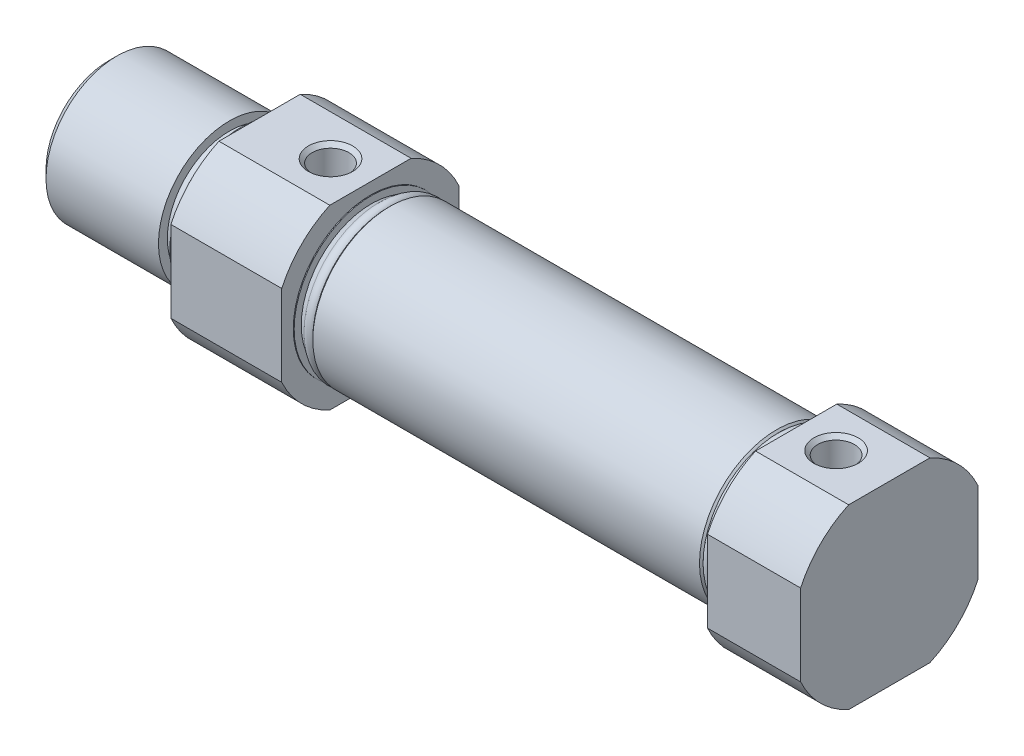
ISO-10303-21;
HEADER;
FILE_DESCRIPTION(('STEP AP214'),'2;1');
FILE_NAME('part.step','',(''),(''),'','','');
FILE_SCHEMA(('AUTOMOTIVE_DESIGN { 1 0 10303 214 1 1 1 1 }'));
ENDSEC;
DATA;
#1=APPLICATION_CONTEXT('core data for automotive mechanical design processes');
#2=APPLICATION_PROTOCOL_DEFINITION('international standard','automotive_design',2000,#1);
#3=PRODUCT_CONTEXT('',#1,'mechanical');
#4=PRODUCT('Part','Part','',(#3));
#5=PRODUCT_RELATED_PRODUCT_CATEGORY('part','',(#4));
#6=PRODUCT_DEFINITION_FORMATION('','',#4);
#7=PRODUCT_DEFINITION_CONTEXT('part definition',#1,'design');
#8=PRODUCT_DEFINITION('design','',#6,#7);
#9=PRODUCT_DEFINITION_SHAPE('','',#8);
#10=(LENGTH_UNIT() NAMED_UNIT(*) SI_UNIT(.MILLI.,.METRE.));
#11=(NAMED_UNIT(*) PLANE_ANGLE_UNIT() SI_UNIT($,.RADIAN.));
#12=(NAMED_UNIT(*) SI_UNIT($,.STERADIAN.) SOLID_ANGLE_UNIT());
#13=UNCERTAINTY_MEASURE_WITH_UNIT(LENGTH_MEASURE(1.E-05),#10,'distance_accuracy_value','');
#14=(GEOMETRIC_REPRESENTATION_CONTEXT(3) GLOBAL_UNCERTAINTY_ASSIGNED_CONTEXT((#13)) GLOBAL_UNIT_ASSIGNED_CONTEXT((#10,
#11,#12)) REPRESENTATION_CONTEXT('',''));
#15=CARTESIAN_POINT('',(0.,0.,0.));
#16=DIRECTION('',(0.,0.,1.));
#17=DIRECTION('',(1.,0.,0.));
#18=AXIS2_PLACEMENT_3D('',#15,#16,#17);
#19=CARTESIAN_POINT('',(60.5,8.7,0.));
#20=DIRECTION('',(1.,0.,0.));
#21=DIRECTION('',(0.,0.,-1.));
#22=AXIS2_PLACEMENT_3D('',#19,#20,#21);
#23=PLANE('',#22);
#24=CARTESIAN_POINT('',(60.5,0.,0.));
#25=DIRECTION('',(-1.,0.,0.));
#26=DIRECTION('',(0.,0.,1.));
#27=AXIS2_PLACEMENT_3D('',#24,#25,#26);
#28=CIRCLE('',#27,8.7);
#29=CARTESIAN_POINT('',(60.5,0.,8.7));
#30=VERTEX_POINT('',#29);
#31=EDGE_CURVE('E412',#30,#30,#28,.T.);
#32=ORIENTED_EDGE('',*,*,#31,.F.);
#33=EDGE_LOOP('',(#32));
#34=FACE_BOUND('',#33,.T.);
#35=DIRECTION('',(0.,0.,1.));
#36=VECTOR('',#35,1.);
#37=CARTESIAN_POINT('',(60.5,10.,-10.));
#38=LINE('',#37,#36);
#39=CARTESIAN_POINT('',(60.5,10.,-4.58257569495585));
#40=VERTEX_POINT('',#39);
#41=CARTESIAN_POINT('',(60.5,10.,4.58257569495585));
#42=VERTEX_POINT('',#41);
#43=EDGE_CURVE('E217',#40,#42,#38,.T.);
#44=ORIENTED_EDGE('',*,*,#43,.F.);
#45=CARTESIAN_POINT('',(60.5,0.,0.));
#46=DIRECTION('',(-1.,0.,0.));
#47=DIRECTION('',(0.,0.,1.));
#48=AXIS2_PLACEMENT_3D('',#45,#46,#47);
#49=CIRCLE('',#48,11.);
#50=CARTESIAN_POINT('',(60.5,4.58257569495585,-10.));
#51=VERTEX_POINT('',#50);
#52=EDGE_CURVE('E410',#40,#51,#49,.T.);
#53=ORIENTED_EDGE('',*,*,#52,.T.);
#54=DIRECTION('',(0.,1.,0.));
#55=VECTOR('',#54,1.);
#56=CARTESIAN_POINT('',(60.5,-10.,-10.));
#57=LINE('',#56,#55);
#58=CARTESIAN_POINT('',(60.5,-4.58257569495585,-10.));
#59=VERTEX_POINT('',#58);
#60=EDGE_CURVE('E211',#59,#51,#57,.T.);
#61=ORIENTED_EDGE('',*,*,#60,.F.);
#62=CARTESIAN_POINT('',(60.5,-10.,-4.58257569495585));
#63=VERTEX_POINT('',#62);
#64=EDGE_CURVE('E155',#59,#63,#49,.T.);
#65=ORIENTED_EDGE('',*,*,#64,.T.);
#66=DIRECTION('',(0.,0.,-1.));
#67=VECTOR('',#66,1.);
#68=CARTESIAN_POINT('',(60.5,-10.,10.));
#69=LINE('',#68,#67);
#70=CARTESIAN_POINT('',(60.5,-10.,4.58257569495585));
#71=VERTEX_POINT('',#70);
#72=EDGE_CURVE('E213',#71,#63,#69,.T.);
#73=ORIENTED_EDGE('',*,*,#72,.F.);
#74=CARTESIAN_POINT('',(60.5,-4.58257569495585,10.));
#75=VERTEX_POINT('',#74);
#76=EDGE_CURVE('E150',#71,#75,#49,.T.);
#77=ORIENTED_EDGE('',*,*,#76,.T.);
#78=DIRECTION('',(0.,-1.,0.));
#79=VECTOR('',#78,1.);
#80=CARTESIAN_POINT('',(60.5,10.,10.));
#81=LINE('',#80,#79);
#82=CARTESIAN_POINT('',(60.5,4.58257569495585,10.));
#83=VERTEX_POINT('',#82);
#84=EDGE_CURVE('E215',#83,#75,#81,.T.);
#85=ORIENTED_EDGE('',*,*,#84,.F.);
#86=EDGE_CURVE('E145',#83,#42,#49,.T.);
#87=ORIENTED_EDGE('',*,*,#86,.T.);
#88=EDGE_LOOP('',(#44,#53,#61,#65,#73,#77,#85,#87));
#89=FACE_BOUND('',#88,.T.);
#90=ADVANCED_FACE('F16',(#34,#89),#23,.F.);
#91=CARTESIAN_POINT('',(71.,0.,0.));
#92=DIRECTION('',(-1.,0.,0.));
#93=DIRECTION('',(0.,0.,1.));
#94=AXIS2_PLACEMENT_3D('',#91,#92,#93);
#95=CYLINDRICAL_SURFACE('',#94,11.);
#96=DIRECTION('',(-1.,0.,0.));
#97=VECTOR('',#96,1.);
#98=CARTESIAN_POINT('',(71.,10.,-4.58257569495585));
#99=LINE('',#98,#97);
#100=CARTESIAN_POINT('',(71.,10.,-4.58257569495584));
#101=VERTEX_POINT('',#100);
#102=EDGE_CURVE('E199',#101,#40,#99,.T.);
#103=ORIENTED_EDGE('',*,*,#102,.F.);
#104=CARTESIAN_POINT('',(71.,0.,0.));
#105=DIRECTION('',(-1.,0.,0.));
#106=DIRECTION('',(0.,0.,1.));
#107=AXIS2_PLACEMENT_3D('',#104,#105,#106);
#108=CIRCLE('',#107,11.);
#109=CARTESIAN_POINT('',(71.,4.58257569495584,-10.));
#110=VERTEX_POINT('',#109);
#111=EDGE_CURVE('E151',#101,#110,#108,.T.);
#112=ORIENTED_EDGE('',*,*,#111,.T.);
#113=DIRECTION('',(-1.,0.,0.));
#114=VECTOR('',#113,1.);
#115=CARTESIAN_POINT('',(71.,4.58257569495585,-10.));
#116=LINE('',#115,#114);
#117=EDGE_CURVE('E205',#51,#110,#116,.F.);
#118=ORIENTED_EDGE('',*,*,#117,.F.);
#119=ORIENTED_EDGE('',*,*,#52,.F.);
#120=EDGE_LOOP('',(#103,#112,#118,#119));
#121=FACE_BOUND('',#120,.T.);
#122=ADVANCED_FACE('F265',(#121),#95,.T.);
#123=DIRECTION('',(-1.,0.,0.));
#124=VECTOR('',#123,1.);
#125=CARTESIAN_POINT('',(71.,10.,4.58257569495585));
#126=LINE('',#125,#124);
#127=CARTESIAN_POINT('',(71.,10.,4.58257569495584));
#128=VERTEX_POINT('',#127);
#129=EDGE_CURVE('E201',#42,#128,#126,.F.);
#130=ORIENTED_EDGE('',*,*,#129,.F.);
#131=ORIENTED_EDGE('',*,*,#86,.F.);
#132=DIRECTION('',(-1.,0.,0.));
#133=VECTOR('',#132,1.);
#134=CARTESIAN_POINT('',(71.,4.58257569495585,10.));
#135=LINE('',#134,#133);
#136=CARTESIAN_POINT('',(71.,4.58257569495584,10.));
#137=VERTEX_POINT('',#136);
#138=EDGE_CURVE('E129',#137,#83,#135,.T.);
#139=ORIENTED_EDGE('',*,*,#138,.F.);
#140=EDGE_CURVE('E143',#137,#128,#108,.T.);
#141=ORIENTED_EDGE('',*,*,#140,.T.);
#142=EDGE_LOOP('',(#130,#131,#139,#141));
#143=FACE_BOUND('',#142,.T.);
#144=ADVANCED_FACE('F142',(#143),#95,.T.);
#145=DIRECTION('',(-1.,0.,0.));
#146=VECTOR('',#145,1.);
#147=CARTESIAN_POINT('',(71.,-4.58257569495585,-10.));
#148=LINE('',#147,#146);
#149=CARTESIAN_POINT('',(71.,-4.58257569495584,-10.));
#150=VERTEX_POINT('',#149);
#151=EDGE_CURVE('E203',#150,#59,#148,.T.);
#152=ORIENTED_EDGE('',*,*,#151,.F.);
#153=CARTESIAN_POINT('',(71.,-10.,-4.58257569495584));
#154=VERTEX_POINT('',#153);
#155=EDGE_CURVE('E158',#150,#154,#108,.T.);
#156=ORIENTED_EDGE('',*,*,#155,.T.);
#157=DIRECTION('',(-1.,0.,0.));
#158=VECTOR('',#157,1.);
#159=CARTESIAN_POINT('',(71.,-10.,-4.58257569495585));
#160=LINE('',#159,#158);
#161=EDGE_CURVE('E40',#63,#154,#160,.F.);
#162=ORIENTED_EDGE('',*,*,#161,.F.);
#163=ORIENTED_EDGE('',*,*,#64,.F.);
#164=EDGE_LOOP('',(#152,#156,#162,#163));
#165=FACE_BOUND('',#164,.T.);
#166=ADVANCED_FACE('F403',(#165),#95,.T.);
#167=DIRECTION('',(-1.,0.,0.));
#168=VECTOR('',#167,1.);
#169=CARTESIAN_POINT('',(71.,-10.,4.58257569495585));
#170=LINE('',#169,#168);
#171=CARTESIAN_POINT('',(71.,-10.,4.58257569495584));
#172=VERTEX_POINT('',#171);
#173=EDGE_CURVE('E207',#172,#71,#170,.T.);
#174=ORIENTED_EDGE('',*,*,#173,.F.);
#175=CARTESIAN_POINT('',(71.,-4.58257569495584,10.));
#176=VERTEX_POINT('',#175);
#177=EDGE_CURVE('E153',#172,#176,#108,.T.);
#178=ORIENTED_EDGE('',*,*,#177,.T.);
#179=DIRECTION('',(-1.,0.,0.));
#180=VECTOR('',#179,1.);
#181=CARTESIAN_POINT('',(71.,-4.58257569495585,10.));
#182=LINE('',#181,#180);
#183=EDGE_CURVE('E32',#75,#176,#182,.F.);
#184=ORIENTED_EDGE('',*,*,#183,.F.);
#185=ORIENTED_EDGE('',*,*,#76,.F.);
#186=EDGE_LOOP('',(#174,#178,#184,#185));
#187=FACE_BOUND('',#186,.T.);
#188=ADVANCED_FACE('F275',(#187),#95,.T.);
#189=CARTESIAN_POINT('',(71.,11.,0.));
#190=DIRECTION('',(-1.,0.,0.));
#191=DIRECTION('',(0.,0.,1.));
#192=AXIS2_PLACEMENT_3D('',#189,#190,#191);
#193=PLANE('',#192);
#194=DIRECTION('',(0.,0.,-1.));
#195=VECTOR('',#194,1.);
#196=CARTESIAN_POINT('',(71.,10.,0.));
#197=LINE('',#196,#195);
#198=EDGE_CURVE('E11',#128,#101,#197,.T.);
#199=ORIENTED_EDGE('',*,*,#198,.F.);
#200=ORIENTED_EDGE('',*,*,#140,.F.);
#201=DIRECTION('',(0.,1.,0.));
#202=VECTOR('',#201,1.);
#203=CARTESIAN_POINT('',(71.,11.,10.));
#204=LINE('',#203,#202);
#205=EDGE_CURVE('E126',#176,#137,#204,.T.);
#206=ORIENTED_EDGE('',*,*,#205,.F.);
#207=ORIENTED_EDGE('',*,*,#177,.F.);
#208=DIRECTION('',(0.,0.,1.));
#209=VECTOR('',#208,1.);
#210=CARTESIAN_POINT('',(71.,-10.,0.));
#211=LINE('',#210,#209);
#212=EDGE_CURVE('E135',#154,#172,#211,.T.);
#213=ORIENTED_EDGE('',*,*,#212,.F.);
#214=ORIENTED_EDGE('',*,*,#155,.F.);
#215=DIRECTION('',(0.,-1.,0.));
#216=VECTOR('',#215,1.);
#217=CARTESIAN_POINT('',(71.,11.,-10.));
#218=LINE('',#217,#216);
#219=EDGE_CURVE('E25',#110,#150,#218,.T.);
#220=ORIENTED_EDGE('',*,*,#219,.F.);
#221=ORIENTED_EDGE('',*,*,#111,.F.);
#222=EDGE_LOOP('',(#199,#200,#206,#207,#213,#214,#220,#221));
#223=FACE_BOUND('',#222,.T.);
#224=ADVANCED_FACE('F148',(#223),#193,.F.);
#225=CARTESIAN_POINT('',(71.,0.,0.));
#226=DIRECTION('',(-1.,0.,0.));
#227=DIRECTION('',(0.,0.,1.));
#228=AXIS2_PLACEMENT_3D('',#225,#226,#227);
#229=CYLINDRICAL_SURFACE('',#228,11.);
#230=CARTESIAN_POINT('',(12.5,0.,0.));
#231=DIRECTION('',(-1.,0.,0.));
#232=DIRECTION('',(0.,0.,1.));
#233=AXIS2_PLACEMENT_3D('',#230,#231,#232);
#234=CIRCLE('',#233,11.);
#235=CARTESIAN_POINT('',(12.5,4.58257569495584,10.));
#236=VERTEX_POINT('',#235);
#237=CARTESIAN_POINT('',(12.5,10.,4.58257569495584));
#238=VERTEX_POINT('',#237);
#239=EDGE_CURVE('E449',#236,#238,#234,.T.);
#240=ORIENTED_EDGE('',*,*,#239,.T.);
#241=DIRECTION('',(-1.,0.,0.));
#242=VECTOR('',#241,1.);
#243=CARTESIAN_POINT('',(71.,10.,4.58257569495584));
#244=LINE('',#243,#242);
#245=CARTESIAN_POINT('',(0.,10.,4.58257569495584));
#246=VERTEX_POINT('',#245);
#247=EDGE_CURVE('E160',#238,#246,#244,.T.);
#248=ORIENTED_EDGE('',*,*,#247,.T.);
#249=CARTESIAN_POINT('',(0.,0.,0.));
#250=DIRECTION('',(-1.,0.,0.));
#251=DIRECTION('',(0.,0.,1.));
#252=AXIS2_PLACEMENT_3D('',#249,#250,#251);
#253=CIRCLE('',#252,11.);
#254=CARTESIAN_POINT('',(0.,4.58257569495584,10.));
#255=VERTEX_POINT('',#254);
#256=EDGE_CURVE('E453',#255,#246,#253,.T.);
#257=ORIENTED_EDGE('',*,*,#256,.F.);
#258=DIRECTION('',(-1.,0.,0.));
#259=VECTOR('',#258,1.);
#260=CARTESIAN_POINT('',(71.,4.58257569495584,10.));
#261=LINE('',#260,#259);
#262=EDGE_CURVE('E176',#255,#236,#261,.F.);
#263=ORIENTED_EDGE('',*,*,#262,.T.);
#264=EDGE_LOOP('',(#240,#248,#257,#263));
#265=FACE_BOUND('',#264,.T.);
#266=ADVANCED_FACE('F334',(#265),#229,.T.);
#267=CARTESIAN_POINT('',(12.5,-10.,4.58257569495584));
#268=VERTEX_POINT('',#267);
#269=CARTESIAN_POINT('',(12.5,-4.58257569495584,10.));
#270=VERTEX_POINT('',#269);
#271=EDGE_CURVE('E448',#268,#270,#234,.T.);
#272=ORIENTED_EDGE('',*,*,#271,.T.);
#273=DIRECTION('',(-1.,0.,0.));
#274=VECTOR('',#273,1.);
#275=CARTESIAN_POINT('',(71.,-4.58257569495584,10.));
#276=LINE('',#275,#274);
#277=CARTESIAN_POINT('',(0.,-4.58257569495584,10.));
#278=VERTEX_POINT('',#277);
#279=EDGE_CURVE('E171',#270,#278,#276,.T.);
#280=ORIENTED_EDGE('',*,*,#279,.T.);
#281=CARTESIAN_POINT('',(0.,-10.,4.58257569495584));
#282=VERTEX_POINT('',#281);
#283=EDGE_CURVE('E451',#282,#278,#253,.T.);
#284=ORIENTED_EDGE('',*,*,#283,.F.);
#285=DIRECTION('',(-1.,0.,0.));
#286=VECTOR('',#285,1.);
#287=CARTESIAN_POINT('',(71.,-10.,4.58257569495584));
#288=LINE('',#287,#286);
#289=EDGE_CURVE('E182',#282,#268,#288,.F.);
#290=ORIENTED_EDGE('',*,*,#289,.T.);
#291=EDGE_LOOP('',(#272,#280,#284,#290));
#292=FACE_BOUND('',#291,.T.);
#293=ADVANCED_FACE('F495',(#292),#229,.T.);
#294=CARTESIAN_POINT('',(12.5,-4.58257569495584,-10.));
#295=VERTEX_POINT('',#294);
#296=CARTESIAN_POINT('',(12.5,-10.,-4.58257569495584));
#297=VERTEX_POINT('',#296);
#298=EDGE_CURVE('E991',#295,#297,#234,.T.);
#299=ORIENTED_EDGE('',*,*,#298,.T.);
#300=DIRECTION('',(-1.,0.,0.));
#301=VECTOR('',#300,1.);
#302=CARTESIAN_POINT('',(71.,-10.,-4.58257569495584));
#303=LINE('',#302,#301);
#304=CARTESIAN_POINT('',(0.,-10.,-4.58257569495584));
#305=VERTEX_POINT('',#304);
#306=EDGE_CURVE('E179',#297,#305,#303,.T.);
#307=ORIENTED_EDGE('',*,*,#306,.T.);
#308=CARTESIAN_POINT('',(0.,-4.58257569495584,-10.));
#309=VERTEX_POINT('',#308);
#310=EDGE_CURVE('E489',#309,#305,#253,.T.);
#311=ORIENTED_EDGE('',*,*,#310,.F.);
#312=DIRECTION('',(-1.,0.,0.));
#313=VECTOR('',#312,1.);
#314=CARTESIAN_POINT('',(71.,-4.58257569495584,-10.));
#315=LINE('',#314,#313);
#316=EDGE_CURVE('E188',#309,#295,#315,.F.);
#317=ORIENTED_EDGE('',*,*,#316,.T.);
#318=EDGE_LOOP('',(#299,#307,#311,#317));
#319=FACE_BOUND('',#318,.T.);
#320=ADVANCED_FACE('F335',(#319),#229,.T.);
#321=CARTESIAN_POINT('',(-17.,0.,0.));
#322=DIRECTION('',(1.,0.,0.));
#323=DIRECTION('',(0.,0.,-1.));
#324=AXIS2_PLACEMENT_3D('',#321,#322,#323);
#325=PLANE('',#324);
#326=CARTESIAN_POINT('',(-17.,0.,0.));
#327=DIRECTION('',(1.,0.,0.));
#328=DIRECTION('',(0.,0.,-1.));
#329=AXIS2_PLACEMENT_3D('',#326,#327,#328);
#330=CIRCLE('',#329,3.);
#331=CARTESIAN_POINT('',(-17.,0.,-3.));
#332=VERTEX_POINT('',#331);
#333=EDGE_CURVE('E20',#332,#332,#330,.F.);
#334=ORIENTED_EDGE('',*,*,#333,.F.);
#335=EDGE_LOOP('',(#334));
#336=FACE_BOUND('',#335,.T.);
#337=CARTESIAN_POINT('',(-17.,0.,0.));
#338=DIRECTION('',(-1.,0.,0.));
#339=DIRECTION('',(0.,0.,1.));
#340=AXIS2_PLACEMENT_3D('',#337,#338,#339);
#341=CIRCLE('',#340,7.08);
#342=CARTESIAN_POINT('',(-17.,0.,7.08));
#343=VERTEX_POINT('',#342);
#344=EDGE_CURVE('E370',#343,#343,#341,.T.);
#345=ORIENTED_EDGE('',*,*,#344,.T.);
#346=EDGE_LOOP('',(#345));
#347=FACE_BOUND('',#346,.T.);
#348=ADVANCED_FACE('F18',(#336,#347),#325,.F.);
#349=CARTESIAN_POINT('',(-16.08,0.,0.));
#350=DIRECTION('',(1.,0.,0.));
#351=DIRECTION('',(0.,0.,-1.));
#352=AXIS2_PLACEMENT_3D('',#349,#350,#351);
#353=CONICAL_SURFACE('',#352,8.,0.785398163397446);
#354=ORIENTED_EDGE('',*,*,#344,.F.);
#355=EDGE_LOOP('',(#354));
#356=FACE_BOUND('',#355,.T.);
#357=CARTESIAN_POINT('',(-16.08,0.,0.));
#358=DIRECTION('',(-1.,0.,0.));
#359=DIRECTION('',(0.,0.,1.));
#360=AXIS2_PLACEMENT_3D('',#357,#358,#359);
#361=CIRCLE('',#360,8.);
#362=CARTESIAN_POINT('',(-16.08,0.,8.));
#363=VERTEX_POINT('',#362);
#364=EDGE_CURVE('E373',#363,#363,#361,.T.);
#365=ORIENTED_EDGE('',*,*,#364,.T.);
#366=EDGE_LOOP('',(#365));
#367=FACE_BOUND('',#366,.T.);
#368=ADVANCED_FACE('F357',(#356,#367),#353,.T.);
#369=CARTESIAN_POINT('',(0.,0.,0.));
#370=DIRECTION('',(-1.,0.,0.));
#371=DIRECTION('',(0.,0.,1.));
#372=AXIS2_PLACEMENT_3D('',#369,#370,#371);
#373=CYLINDRICAL_SURFACE('',#372,8.);
#374=ORIENTED_EDGE('',*,*,#364,.F.);
#375=EDGE_LOOP('',(#374));
#376=FACE_BOUND('',#375,.T.);
#377=CARTESIAN_POINT('',(-3.4,0.,0.));
#378=DIRECTION('',(-1.,0.,0.));
#379=DIRECTION('',(0.,0.,1.));
#380=AXIS2_PLACEMENT_3D('',#377,#378,#379);
#381=CIRCLE('',#380,8.);
#382=CARTESIAN_POINT('',(-3.4,0.,8.));
#383=VERTEX_POINT('',#382);
#384=EDGE_CURVE('E374',#383,#383,#381,.T.);
#385=ORIENTED_EDGE('',*,*,#384,.T.);
#386=EDGE_LOOP('',(#385));
#387=FACE_BOUND('',#386,.T.);
#388=ADVANCED_FACE('F354',(#376,#387),#373,.T.);
#389=CARTESIAN_POINT('',(-3.4,8.,0.));
#390=DIRECTION('',(-1.,0.,0.));
#391=DIRECTION('',(0.,0.,1.));
#392=AXIS2_PLACEMENT_3D('',#389,#390,#391);
#393=PLANE('',#392);
#394=ORIENTED_EDGE('',*,*,#384,.F.);
#395=EDGE_LOOP('',(#394));
#396=FACE_BOUND('',#395,.T.);
#397=CARTESIAN_POINT('',(-3.4,0.,0.));
#398=DIRECTION('',(-1.,0.,0.));
#399=DIRECTION('',(0.,0.,1.));
#400=AXIS2_PLACEMENT_3D('',#397,#398,#399);
#401=CIRCLE('',#400,7.);
#402=CARTESIAN_POINT('',(-3.4,0.,7.));
#403=VERTEX_POINT('',#402);
#404=EDGE_CURVE('E379',#403,#403,#401,.T.);
#405=ORIENTED_EDGE('',*,*,#404,.T.);
#406=EDGE_LOOP('',(#405));
#407=FACE_BOUND('',#406,.T.);
#408=ADVANCED_FACE('F350',(#396,#407),#393,.F.);
#409=CARTESIAN_POINT('',(0.,0.,0.));
#410=DIRECTION('',(-1.,0.,0.));
#411=DIRECTION('',(0.,0.,1.));
#412=AXIS2_PLACEMENT_3D('',#409,#410,#411);
#413=CYLINDRICAL_SURFACE('',#412,7.);
#414=ORIENTED_EDGE('',*,*,#404,.F.);
#415=EDGE_LOOP('',(#414));
#416=FACE_BOUND('',#415,.T.);
#417=CARTESIAN_POINT('',(-2.125,0.,0.));
#418=DIRECTION('',(-1.,0.,0.));
#419=DIRECTION('',(0.,0.,1.));
#420=AXIS2_PLACEMENT_3D('',#417,#418,#419);
#421=CIRCLE('',#420,7.);
#422=CARTESIAN_POINT('',(-2.125,0.,7.));
#423=VERTEX_POINT('',#422);
#424=EDGE_CURVE('E462',#423,#423,#421,.T.);
#425=ORIENTED_EDGE('',*,*,#424,.T.);
#426=EDGE_LOOP('',(#425));
#427=FACE_BOUND('',#426,.T.);
#428=ADVANCED_FACE('F346',(#416,#427),#413,.T.);
#429=CARTESIAN_POINT('',(-2.125,7.,0.));
#430=DIRECTION('',(1.,0.,0.));
#431=DIRECTION('',(0.,0.,-1.));
#432=AXIS2_PLACEMENT_3D('',#429,#430,#431);
#433=PLANE('',#432);
#434=ORIENTED_EDGE('',*,*,#424,.F.);
#435=EDGE_LOOP('',(#434));
#436=FACE_BOUND('',#435,.T.);
#437=CARTESIAN_POINT('',(-2.125,0.,0.));
#438=DIRECTION('',(-1.,0.,0.));
#439=DIRECTION('',(0.,0.,1.));
#440=AXIS2_PLACEMENT_3D('',#437,#438,#439);
#441=CIRCLE('',#440,8.);
#442=CARTESIAN_POINT('',(-2.125,0.,8.));
#443=VERTEX_POINT('',#442);
#444=EDGE_CURVE('E459',#443,#443,#441,.T.);
#445=ORIENTED_EDGE('',*,*,#444,.T.);
#446=EDGE_LOOP('',(#445));
#447=FACE_BOUND('',#446,.T.);
#448=ADVANCED_FACE('F342',(#436,#447),#433,.F.);
#449=CARTESIAN_POINT('',(0.,0.,0.));
#450=DIRECTION('',(-1.,0.,0.));
#451=DIRECTION('',(0.,0.,1.));
#452=AXIS2_PLACEMENT_3D('',#449,#450,#451);
#453=CYLINDRICAL_SURFACE('',#452,8.);
#454=ORIENTED_EDGE('',*,*,#444,.F.);
#455=EDGE_LOOP('',(#454));
#456=FACE_BOUND('',#455,.T.);
#457=CARTESIAN_POINT('',(0.,0.,0.));
#458=DIRECTION('',(1.,0.,0.));
#459=DIRECTION('',(0.,0.,-1.));
#460=AXIS2_PLACEMENT_3D('',#457,#458,#459);
#461=CIRCLE('',#460,8.);
#462=CARTESIAN_POINT('',(0.,0.,-8.));
#463=VERTEX_POINT('',#462);
#464=EDGE_CURVE('E455',#463,#463,#461,.T.);
#465=ORIENTED_EDGE('',*,*,#464,.F.);
#466=EDGE_LOOP('',(#465));
#467=FACE_BOUND('',#466,.T.);
#468=ADVANCED_FACE('F338',(#456,#467),#453,.T.);
#469=CARTESIAN_POINT('',(0.,0.,0.));
#470=DIRECTION('',(1.,0.,0.));
#471=DIRECTION('',(0.,0.,-1.));
#472=AXIS2_PLACEMENT_3D('',#469,#470,#471);
#473=PLANE('',#472);
#474=ORIENTED_EDGE('',*,*,#464,.T.);
#475=EDGE_LOOP('',(#474));
#476=FACE_BOUND('',#475,.T.);
#477=ORIENTED_EDGE('',*,*,#256,.T.);
#478=DIRECTION('',(0.,0.,1.));
#479=VECTOR('',#478,1.);
#480=CARTESIAN_POINT('',(0.,10.,-10.));
#481=LINE('',#480,#479);
#482=CARTESIAN_POINT('',(0.,10.,-4.58257569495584));
#483=VERTEX_POINT('',#482);
#484=EDGE_CURVE('E197',#483,#246,#481,.T.);
#485=ORIENTED_EDGE('',*,*,#484,.F.);
#486=CARTESIAN_POINT('',(0.,4.58257569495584,-10.));
#487=VERTEX_POINT('',#486);
#488=EDGE_CURVE('E456',#483,#487,#253,.T.);
#489=ORIENTED_EDGE('',*,*,#488,.T.);
#490=DIRECTION('',(0.,1.,0.));
#491=VECTOR('',#490,1.);
#492=CARTESIAN_POINT('',(0.,-10.,-10.));
#493=LINE('',#492,#491);
#494=EDGE_CURVE('E191',#309,#487,#493,.T.);
#495=ORIENTED_EDGE('',*,*,#494,.F.);
#496=ORIENTED_EDGE('',*,*,#310,.T.);
#497=DIRECTION('',(0.,0.,-1.));
#498=VECTOR('',#497,1.);
#499=CARTESIAN_POINT('',(0.,-10.,10.));
#500=LINE('',#499,#498);
#501=EDGE_CURVE('E193',#282,#305,#500,.T.);
#502=ORIENTED_EDGE('',*,*,#501,.F.);
#503=ORIENTED_EDGE('',*,*,#283,.T.);
#504=DIRECTION('',(0.,-1.,0.));
#505=VECTOR('',#504,1.);
#506=CARTESIAN_POINT('',(0.,10.,10.));
#507=LINE('',#506,#505);
#508=EDGE_CURVE('E195',#255,#278,#507,.T.);
#509=ORIENTED_EDGE('',*,*,#508,.F.);
#510=EDGE_LOOP('',(#477,#485,#489,#495,#496,#502,#503,#509));
#511=FACE_BOUND('',#510,.T.);
#512=ADVANCED_FACE('F332',(#476,#511),#473,.F.);
#513=ORIENTED_EDGE('',*,*,#488,.F.);
#514=DIRECTION('',(-1.,0.,0.));
#515=VECTOR('',#514,1.);
#516=CARTESIAN_POINT('',(71.,10.,-4.58257569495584));
#517=LINE('',#516,#515);
#518=CARTESIAN_POINT('',(12.5,10.,-4.58257569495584));
#519=VERTEX_POINT('',#518);
#520=EDGE_CURVE('E165',#483,#519,#517,.F.);
#521=ORIENTED_EDGE('',*,*,#520,.T.);
#522=CARTESIAN_POINT('',(12.5,4.58257569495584,-10.));
#523=VERTEX_POINT('',#522);
#524=EDGE_CURVE('E452',#519,#523,#234,.T.);
#525=ORIENTED_EDGE('',*,*,#524,.T.);
#526=DIRECTION('',(-1.,0.,0.));
#527=VECTOR('',#526,1.);
#528=CARTESIAN_POINT('',(71.,4.58257569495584,-10.));
#529=LINE('',#528,#527);
#530=EDGE_CURVE('E185',#523,#487,#529,.T.);
#531=ORIENTED_EDGE('',*,*,#530,.T.);
#532=EDGE_LOOP('',(#513,#521,#525,#531));
#533=FACE_BOUND('',#532,.T.);
#534=ADVANCED_FACE('F328',(#533),#229,.T.);
#535=CARTESIAN_POINT('',(12.5,11.,0.));
#536=DIRECTION('',(-1.,0.,0.));
#537=DIRECTION('',(0.,0.,1.));
#538=AXIS2_PLACEMENT_3D('',#535,#536,#537);
#539=PLANE('',#538);
#540=ORIENTED_EDGE('',*,*,#524,.F.);
#541=DIRECTION('',(0.,0.,1.));
#542=VECTOR('',#541,1.);
#543=CARTESIAN_POINT('',(12.5,10.,0.));
#544=LINE('',#543,#542);
#545=EDGE_CURVE('E136',#519,#238,#544,.T.);
#546=ORIENTED_EDGE('',*,*,#545,.T.);
#547=ORIENTED_EDGE('',*,*,#239,.F.);
#548=DIRECTION('',(0.,-1.,0.));
#549=VECTOR('',#548,1.);
#550=CARTESIAN_POINT('',(12.5,11.,10.));
#551=LINE('',#550,#549);
#552=EDGE_CURVE('E388',#236,#270,#551,.T.);
#553=ORIENTED_EDGE('',*,*,#552,.T.);
#554=ORIENTED_EDGE('',*,*,#271,.F.);
#555=DIRECTION('',(0.,0.,-1.));
#556=VECTOR('',#555,1.);
#557=CARTESIAN_POINT('',(12.5,-10.,0.));
#558=LINE('',#557,#556);
#559=EDGE_CURVE('E385',#268,#297,#558,.T.);
#560=ORIENTED_EDGE('',*,*,#559,.T.);
#561=ORIENTED_EDGE('',*,*,#298,.F.);
#562=DIRECTION('',(0.,1.,0.));
#563=VECTOR('',#562,1.);
#564=CARTESIAN_POINT('',(12.5,11.,-10.));
#565=LINE('',#564,#563);
#566=EDGE_CURVE('E376',#295,#523,#565,.T.);
#567=ORIENTED_EDGE('',*,*,#566,.T.);
#568=EDGE_LOOP('',(#540,#546,#547,#553,#554,#560,#561,#567));
#569=FACE_BOUND('',#568,.T.);
#570=CARTESIAN_POINT('',(12.5,0.,0.));
#571=DIRECTION('',(-1.,0.,0.));
#572=DIRECTION('',(0.,0.,1.));
#573=AXIS2_PLACEMENT_3D('',#570,#571,#572);
#574=CIRCLE('',#573,8.7);
#575=CARTESIAN_POINT('',(12.5,0.,8.7));
#576=VERTEX_POINT('',#575);
#577=EDGE_CURVE('E445',#576,#576,#574,.T.);
#578=ORIENTED_EDGE('',*,*,#577,.T.);
#579=EDGE_LOOP('',(#578));
#580=FACE_BOUND('',#579,.T.);
#581=ADVANCED_FACE('F324',(#569,#580),#539,.F.);
#582=CARTESIAN_POINT('',(71.,0.,0.));
#583=DIRECTION('',(-1.,0.,0.));
#584=DIRECTION('',(0.,0.,1.));
#585=AXIS2_PLACEMENT_3D('',#582,#583,#584);
#586=CYLINDRICAL_SURFACE('',#585,8.7);
#587=ORIENTED_EDGE('',*,*,#577,.F.);
#588=EDGE_LOOP('',(#587));
#589=FACE_BOUND('',#588,.T.);
#590=CARTESIAN_POINT('',(12.6,0.,0.));
#591=DIRECTION('',(-1.,0.,0.));
#592=DIRECTION('',(0.,0.,1.));
#593=AXIS2_PLACEMENT_3D('',#590,#591,#592);
#594=CIRCLE('',#593,8.7);
#595=CARTESIAN_POINT('',(12.6,0.,8.7));
#596=VERTEX_POINT('',#595);
#597=EDGE_CURVE('E442',#596,#596,#594,.T.);
#598=ORIENTED_EDGE('',*,*,#597,.T.);
#599=EDGE_LOOP('',(#598));
#600=FACE_BOUND('',#599,.T.);
#601=ADVANCED_FACE('F320',(#589,#600),#586,.T.);
#602=CARTESIAN_POINT('',(12.6,8.7,0.));
#603=DIRECTION('',(-1.,0.,0.));
#604=DIRECTION('',(0.,0.,1.));
#605=AXIS2_PLACEMENT_3D('',#602,#603,#604);
#606=PLANE('',#605);
#607=ORIENTED_EDGE('',*,*,#597,.F.);
#608=EDGE_LOOP('',(#607));
#609=FACE_BOUND('',#608,.T.);
#610=CARTESIAN_POINT('',(12.6,0.,0.));
#611=DIRECTION('',(-1.,0.,0.));
#612=DIRECTION('',(0.,0.,1.));
#613=AXIS2_PLACEMENT_3D('',#610,#611,#612);
#614=CIRCLE('',#613,7.9);
#615=CARTESIAN_POINT('',(12.6,0.,7.9));
#616=VERTEX_POINT('',#615);
#617=EDGE_CURVE('E439',#616,#616,#614,.T.);
#618=ORIENTED_EDGE('',*,*,#617,.T.);
#619=EDGE_LOOP('',(#618));
#620=FACE_BOUND('',#619,.T.);
#621=ADVANCED_FACE('F316',(#609,#620),#606,.F.);
#622=CARTESIAN_POINT('',(13.5,0.,0.));
#623=DIRECTION('',(1.,0.,0.));
#624=DIRECTION('',(0.,0.,-1.));
#625=AXIS2_PLACEMENT_3D('',#622,#623,#624);
#626=CONICAL_SURFACE('',#625,8.5,0.58800260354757);
#627=ORIENTED_EDGE('',*,*,#617,.F.);
#628=EDGE_LOOP('',(#627));
#629=FACE_BOUND('',#628,.T.);
#630=CARTESIAN_POINT('',(13.5,0.,0.));
#631=DIRECTION('',(-1.,0.,0.));
#632=DIRECTION('',(0.,0.,1.));
#633=AXIS2_PLACEMENT_3D('',#630,#631,#632);
#634=CIRCLE('',#633,8.5);
#635=CARTESIAN_POINT('',(13.5,0.,8.5));
#636=VERTEX_POINT('',#635);
#637=EDGE_CURVE('E436',#636,#636,#634,.T.);
#638=ORIENTED_EDGE('',*,*,#637,.T.);
#639=EDGE_LOOP('',(#638));
#640=FACE_BOUND('',#639,.T.);
#641=ADVANCED_FACE('F312',(#629,#640),#626,.T.);
#642=CARTESIAN_POINT('',(14.,0.,0.));
#643=DIRECTION('',(-1.,0.,0.));
#644=DIRECTION('',(0.,0.,1.));
#645=AXIS2_PLACEMENT_3D('',#642,#643,#644);
#646=TOROIDAL_SURFACE('',#645,7.975,0.725);
#647=ORIENTED_EDGE('',*,*,#637,.F.);
#648=EDGE_LOOP('',(#647));
#649=FACE_BOUND('',#648,.T.);
#650=CARTESIAN_POINT('',(14.5,0.,0.));
#651=DIRECTION('',(-1.,0.,0.));
#652=DIRECTION('',(0.,0.,1.));
#653=AXIS2_PLACEMENT_3D('',#650,#651,#652);
#654=CIRCLE('',#653,8.5);
#655=CARTESIAN_POINT('',(14.5,0.,8.5));
#656=VERTEX_POINT('',#655);
#657=EDGE_CURVE('E433',#656,#656,#654,.T.);
#658=ORIENTED_EDGE('',*,*,#657,.T.);
#659=EDGE_LOOP('',(#658));
#660=FACE_BOUND('',#659,.T.);
#661=ADVANCED_FACE('F308',(#649,#660),#646,.T.);
#662=CARTESIAN_POINT('',(14.7,0.,0.));
#663=DIRECTION('',(1.,0.,0.));
#664=DIRECTION('',(0.,0.,-1.));
#665=AXIS2_PLACEMENT_3D('',#662,#663,#664);
#666=CONICAL_SURFACE('',#665,8.7,0.785398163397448);
#667=ORIENTED_EDGE('',*,*,#657,.F.);
#668=EDGE_LOOP('',(#667));
#669=FACE_BOUND('',#668,.T.);
#670=CARTESIAN_POINT('',(14.7,0.,0.));
#671=DIRECTION('',(-1.,0.,0.));
#672=DIRECTION('',(0.,0.,1.));
#673=AXIS2_PLACEMENT_3D('',#670,#671,#672);
#674=CIRCLE('',#673,8.7);
#675=CARTESIAN_POINT('',(14.7,0.,8.7));
#676=VERTEX_POINT('',#675);
#677=EDGE_CURVE('E430',#676,#676,#674,.T.);
#678=ORIENTED_EDGE('',*,*,#677,.T.);
#679=EDGE_LOOP('',(#678));
#680=FACE_BOUND('',#679,.T.);
#681=ADVANCED_FACE('F304',(#669,#680),#666,.T.);
#682=CARTESIAN_POINT('',(71.,0.,0.));
#683=DIRECTION('',(-1.,0.,0.));
#684=DIRECTION('',(0.,0.,1.));
#685=AXIS2_PLACEMENT_3D('',#682,#683,#684);
#686=CYLINDRICAL_SURFACE('',#685,8.7);
#687=ORIENTED_EDGE('',*,*,#677,.F.);
#688=EDGE_LOOP('',(#687));
#689=FACE_BOUND('',#688,.T.);
#690=CARTESIAN_POINT('',(58.3,0.,0.));
#691=DIRECTION('',(-1.,0.,0.));
#692=DIRECTION('',(0.,0.,1.));
#693=AXIS2_PLACEMENT_3D('',#690,#691,#692);
#694=CIRCLE('',#693,8.7);
#695=CARTESIAN_POINT('',(58.3,0.,8.7));
#696=VERTEX_POINT('',#695);
#697=EDGE_CURVE('E427',#696,#696,#694,.T.);
#698=ORIENTED_EDGE('',*,*,#697,.T.);
#699=EDGE_LOOP('',(#698));
#700=FACE_BOUND('',#699,.T.);
#701=ADVANCED_FACE('F300',(#689,#700),#686,.T.);
#702=CARTESIAN_POINT('',(58.5,0.,0.));
#703=DIRECTION('',(-1.,0.,0.));
#704=DIRECTION('',(0.,0.,1.));
#705=AXIS2_PLACEMENT_3D('',#702,#703,#704);
#706=CONICAL_SURFACE('',#705,8.5,0.785398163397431);
#707=ORIENTED_EDGE('',*,*,#697,.F.);
#708=EDGE_LOOP('',(#707));
#709=FACE_BOUND('',#708,.T.);
#710=CARTESIAN_POINT('',(58.5,0.,0.));
#711=DIRECTION('',(-1.,0.,0.));
#712=DIRECTION('',(0.,0.,1.));
#713=AXIS2_PLACEMENT_3D('',#710,#711,#712);
#714=CIRCLE('',#713,8.5);
#715=CARTESIAN_POINT('',(58.5,0.,8.5));
#716=VERTEX_POINT('',#715);
#717=EDGE_CURVE('E424',#716,#716,#714,.T.);
#718=ORIENTED_EDGE('',*,*,#717,.T.);
#719=EDGE_LOOP('',(#718));
#720=FACE_BOUND('',#719,.T.);
#721=ADVANCED_FACE('F296',(#709,#720),#706,.T.);
#722=CARTESIAN_POINT('',(59.,0.,0.));
#723=DIRECTION('',(-1.,0.,0.));
#724=DIRECTION('',(0.,0.,1.));
#725=AXIS2_PLACEMENT_3D('',#722,#723,#724);
#726=TOROIDAL_SURFACE('',#725,7.975,0.725);
#727=ORIENTED_EDGE('',*,*,#717,.F.);
#728=EDGE_LOOP('',(#727));
#729=FACE_BOUND('',#728,.T.);
#730=CARTESIAN_POINT('',(59.5,0.,0.));
#731=DIRECTION('',(-1.,0.,0.));
#732=DIRECTION('',(0.,0.,1.));
#733=AXIS2_PLACEMENT_3D('',#730,#731,#732);
#734=CIRCLE('',#733,8.5);
#735=CARTESIAN_POINT('',(59.5,0.,8.5));
#736=VERTEX_POINT('',#735);
#737=EDGE_CURVE('E421',#736,#736,#734,.T.);
#738=ORIENTED_EDGE('',*,*,#737,.T.);
#739=EDGE_LOOP('',(#738));
#740=FACE_BOUND('',#739,.T.);
#741=ADVANCED_FACE('F292',(#729,#740),#726,.T.);
#742=CARTESIAN_POINT('',(60.4,0.,0.));
#743=DIRECTION('',(-1.,0.,0.));
#744=DIRECTION('',(0.,0.,1.));
#745=AXIS2_PLACEMENT_3D('',#742,#743,#744);
#746=CONICAL_SURFACE('',#745,7.9,0.588002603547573);
#747=ORIENTED_EDGE('',*,*,#737,.F.);
#748=EDGE_LOOP('',(#747));
#749=FACE_BOUND('',#748,.T.);
#750=CARTESIAN_POINT('',(60.4,0.,0.));
#751=DIRECTION('',(-1.,0.,0.));
#752=DIRECTION('',(0.,0.,1.));
#753=AXIS2_PLACEMENT_3D('',#750,#751,#752);
#754=CIRCLE('',#753,7.9);
#755=CARTESIAN_POINT('',(60.4,0.,7.9));
#756=VERTEX_POINT('',#755);
#757=EDGE_CURVE('E418',#756,#756,#754,.T.);
#758=ORIENTED_EDGE('',*,*,#757,.T.);
#759=EDGE_LOOP('',(#758));
#760=FACE_BOUND('',#759,.T.);
#761=ADVANCED_FACE('F288',(#749,#760),#746,.T.);
#762=CARTESIAN_POINT('',(60.4,7.9,0.));
#763=DIRECTION('',(1.,0.,0.));
#764=DIRECTION('',(0.,0.,-1.));
#765=AXIS2_PLACEMENT_3D('',#762,#763,#764);
#766=PLANE('',#765);
#767=ORIENTED_EDGE('',*,*,#757,.F.);
#768=EDGE_LOOP('',(#767));
#769=FACE_BOUND('',#768,.T.);
#770=CARTESIAN_POINT('',(60.4,0.,0.));
#771=DIRECTION('',(-1.,0.,0.));
#772=DIRECTION('',(0.,0.,1.));
#773=AXIS2_PLACEMENT_3D('',#770,#771,#772);
#774=CIRCLE('',#773,8.7);
#775=CARTESIAN_POINT('',(60.4,0.,8.7));
#776=VERTEX_POINT('',#775);
#777=EDGE_CURVE('E415',#776,#776,#774,.T.);
#778=ORIENTED_EDGE('',*,*,#777,.T.);
#779=EDGE_LOOP('',(#778));
#780=FACE_BOUND('',#779,.T.);
#781=ADVANCED_FACE('F284',(#769,#780),#766,.F.);
#782=CARTESIAN_POINT('',(71.,0.,0.));
#783=DIRECTION('',(-1.,0.,0.));
#784=DIRECTION('',(0.,0.,1.));
#785=AXIS2_PLACEMENT_3D('',#782,#783,#784);
#786=CYLINDRICAL_SURFACE('',#785,8.7);
#787=ORIENTED_EDGE('',*,*,#777,.F.);
#788=EDGE_LOOP('',(#787));
#789=FACE_BOUND('',#788,.T.);
#790=ORIENTED_EDGE('',*,*,#31,.T.);
#791=EDGE_LOOP('',(#790));
#792=FACE_BOUND('',#791,.T.);
#793=ADVANCED_FACE('F280',(#789,#792),#786,.T.);
#794=CARTESIAN_POINT('',(12.5,-10.,-10.));
#795=DIRECTION('',(0.,0.,1.));
#796=DIRECTION('',(1.,0.,0.));
#797=AXIS2_PLACEMENT_3D('',#794,#795,#796);
#798=PLANE('',#797);
#799=ORIENTED_EDGE('',*,*,#566,.F.);
#800=ORIENTED_EDGE('',*,*,#316,.F.);
#801=ORIENTED_EDGE('',*,*,#494,.T.);
#802=ORIENTED_EDGE('',*,*,#530,.F.);
#803=EDGE_LOOP('',(#799,#800,#801,#802));
#804=FACE_BOUND('',#803,.T.);
#805=ADVANCED_FACE('F283',(#804),#798,.F.);
#806=CARTESIAN_POINT('',(12.5,-10.,10.));
#807=DIRECTION('',(0.,1.,0.));
#808=DIRECTION('',(0.,0.,1.));
#809=AXIS2_PLACEMENT_3D('',#806,#807,#808);
#810=PLANE('',#809);
#811=ORIENTED_EDGE('',*,*,#559,.F.);
#812=ORIENTED_EDGE('',*,*,#289,.F.);
#813=ORIENTED_EDGE('',*,*,#501,.T.);
#814=ORIENTED_EDGE('',*,*,#306,.F.);
#815=EDGE_LOOP('',(#811,#812,#813,#814));
#816=FACE_BOUND('',#815,.T.);
#817=ADVANCED_FACE('F498',(#816),#810,.F.);
#818=CARTESIAN_POINT('',(12.5,10.,10.));
#819=DIRECTION('',(0.,0.,-1.));
#820=DIRECTION('',(-1.,0.,0.));
#821=AXIS2_PLACEMENT_3D('',#818,#819,#820);
#822=PLANE('',#821);
#823=ORIENTED_EDGE('',*,*,#552,.F.);
#824=ORIENTED_EDGE('',*,*,#262,.F.);
#825=ORIENTED_EDGE('',*,*,#508,.T.);
#826=ORIENTED_EDGE('',*,*,#279,.F.);
#827=EDGE_LOOP('',(#823,#824,#825,#826));
#828=FACE_BOUND('',#827,.T.);
#829=ADVANCED_FACE('F496',(#828),#822,.F.);
#830=CARTESIAN_POINT('',(12.5,10.,-10.));
#831=DIRECTION('',(0.,-1.,0.));
#832=DIRECTION('',(0.,0.,-1.));
#833=AXIS2_PLACEMENT_3D('',#830,#831,#832);
#834=PLANE('',#833);
#835=CARTESIAN_POINT('',(8.,10.,0.));
#836=DIRECTION('',(0.,1.,0.));
#837=DIRECTION('',(0.,0.,1.));
#838=AXIS2_PLACEMENT_3D('',#835,#836,#837);
#839=CIRCLE('',#838,2.5);
#840=CARTESIAN_POINT('',(8.,10.,2.5));
#841=VERTEX_POINT('',#840);
#842=EDGE_CURVE('E225',#841,#841,#839,.T.);
#843=ORIENTED_EDGE('',*,*,#842,.F.);
#844=EDGE_LOOP('',(#843));
#845=FACE_BOUND('',#844,.T.);
#846=ORIENTED_EDGE('',*,*,#545,.F.);
#847=ORIENTED_EDGE('',*,*,#520,.F.);
#848=ORIENTED_EDGE('',*,*,#484,.T.);
#849=ORIENTED_EDGE('',*,*,#247,.F.);
#850=EDGE_LOOP('',(#846,#847,#848,#849));
#851=FACE_BOUND('',#850,.T.);
#852=ADVANCED_FACE('F487',(#845,#851),#834,.F.);
#853=CARTESIAN_POINT('',(60.5,10.,10.));
#854=DIRECTION('',(0.,0.,1.));
#855=DIRECTION('',(1.,0.,0.));
#856=AXIS2_PLACEMENT_3D('',#853,#854,#855);
#857=PLANE('',#856);
#858=ORIENTED_EDGE('',*,*,#138,.T.);
#859=ORIENTED_EDGE('',*,*,#84,.T.);
#860=ORIENTED_EDGE('',*,*,#183,.T.);
#861=ORIENTED_EDGE('',*,*,#205,.T.);
#862=EDGE_LOOP('',(#858,#859,#860,#861));
#863=FACE_BOUND('',#862,.T.);
#864=ADVANCED_FACE('F128',(#863),#857,.T.);
#865=CARTESIAN_POINT('',(60.5,-10.,10.));
#866=DIRECTION('',(0.,-1.,0.));
#867=DIRECTION('',(0.,0.,-1.));
#868=AXIS2_PLACEMENT_3D('',#865,#866,#867);
#869=PLANE('',#868);
#870=ORIENTED_EDGE('',*,*,#173,.T.);
#871=ORIENTED_EDGE('',*,*,#72,.T.);
#872=ORIENTED_EDGE('',*,*,#161,.T.);
#873=ORIENTED_EDGE('',*,*,#212,.T.);
#874=EDGE_LOOP('',(#870,#871,#872,#873));
#875=FACE_BOUND('',#874,.T.);
#876=ADVANCED_FACE('F405',(#875),#869,.T.);
#877=CARTESIAN_POINT('',(60.5,-10.,-10.));
#878=DIRECTION('',(0.,0.,-1.));
#879=DIRECTION('',(-1.,0.,0.));
#880=AXIS2_PLACEMENT_3D('',#877,#878,#879);
#881=PLANE('',#880);
#882=ORIENTED_EDGE('',*,*,#151,.T.);
#883=ORIENTED_EDGE('',*,*,#60,.T.);
#884=ORIENTED_EDGE('',*,*,#117,.T.);
#885=ORIENTED_EDGE('',*,*,#219,.T.);
#886=EDGE_LOOP('',(#882,#883,#884,#885));
#887=FACE_BOUND('',#886,.T.);
#888=ADVANCED_FACE('F397',(#887),#881,.T.);
#889=CARTESIAN_POINT('',(60.5,10.,-10.));
#890=DIRECTION('',(0.,1.,0.));
#891=DIRECTION('',(0.,0.,1.));
#892=AXIS2_PLACEMENT_3D('',#889,#890,#891);
#893=PLANE('',#892);
#894=CARTESIAN_POINT('',(65.,10.,0.));
#895=DIRECTION('',(0.,1.,0.));
#896=DIRECTION('',(0.,0.,1.));
#897=AXIS2_PLACEMENT_3D('',#894,#895,#896);
#898=CIRCLE('',#897,2.5);
#899=CARTESIAN_POINT('',(65.,10.,2.5));
#900=VERTEX_POINT('',#899);
#901=EDGE_CURVE('E234',#900,#900,#898,.T.);
#902=ORIENTED_EDGE('',*,*,#901,.F.);
#903=EDGE_LOOP('',(#902));
#904=FACE_BOUND('',#903,.T.);
#905=ORIENTED_EDGE('',*,*,#102,.T.);
#906=ORIENTED_EDGE('',*,*,#43,.T.);
#907=ORIENTED_EDGE('',*,*,#129,.T.);
#908=ORIENTED_EDGE('',*,*,#198,.T.);
#909=EDGE_LOOP('',(#905,#906,#907,#908));
#910=FACE_BOUND('',#909,.T.);
#911=ADVANCED_FACE('F821',(#904,#910),#893,.T.);
#912=CARTESIAN_POINT('',(8.,5.,0.));
#913=DIRECTION('',(0.,-1.,0.));
#914=DIRECTION('',(0.,0.,-1.));
#915=AXIS2_PLACEMENT_3D('',#912,#913,#914);
#916=PLANE('',#915);
#917=CARTESIAN_POINT('',(8.,5.,0.));
#918=DIRECTION('',(0.,1.,0.));
#919=DIRECTION('',(0.,0.,1.));
#920=AXIS2_PLACEMENT_3D('',#917,#918,#919);
#921=CIRCLE('',#920,2.067);
#922=CARTESIAN_POINT('',(8.,5.,2.067));
#923=VERTEX_POINT('',#922);
#924=EDGE_CURVE('E219',#923,#923,#921,.T.);
#925=ORIENTED_EDGE('',*,*,#924,.T.);
#926=EDGE_LOOP('',(#925));
#927=FACE_BOUND('',#926,.T.);
#928=ADVANCED_FACE('F763',(#927),#916,.F.);
#929=CARTESIAN_POINT('',(8.,10.,0.));
#930=DIRECTION('',(0.,1.,0.));
#931=DIRECTION('',(0.,0.,1.));
#932=AXIS2_PLACEMENT_3D('',#929,#930,#931);
#933=CYLINDRICAL_SURFACE('',#932,2.067);
#934=ORIENTED_EDGE('',*,*,#924,.F.);
#935=EDGE_LOOP('',(#934));
#936=FACE_BOUND('',#935,.T.);
#937=CARTESIAN_POINT('',(8.,9.567,0.));
#938=DIRECTION('',(0.,1.,0.));
#939=DIRECTION('',(0.,0.,1.));
#940=AXIS2_PLACEMENT_3D('',#937,#938,#939);
#941=CIRCLE('',#940,2.067);
#942=CARTESIAN_POINT('',(8.,9.567,2.067));
#943=VERTEX_POINT('',#942);
#944=EDGE_CURVE('E222',#943,#943,#941,.T.);
#945=ORIENTED_EDGE('',*,*,#944,.T.);
#946=EDGE_LOOP('',(#945));
#947=FACE_BOUND('',#946,.T.);
#948=ADVANCED_FACE('F757',(#936,#947),#933,.F.);
#949=CARTESIAN_POINT('',(8.,10.,0.));
#950=DIRECTION('',(0.,1.,0.));
#951=DIRECTION('',(0.,0.,1.));
#952=AXIS2_PLACEMENT_3D('',#949,#950,#951);
#953=CONICAL_SURFACE('',#952,2.5,0.785398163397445);
#954=ORIENTED_EDGE('',*,*,#944,.F.);
#955=EDGE_LOOP('',(#954));
#956=FACE_BOUND('',#955,.T.);
#957=ORIENTED_EDGE('',*,*,#842,.T.);
#958=EDGE_LOOP('',(#957));
#959=FACE_BOUND('',#958,.T.);
#960=ADVANCED_FACE('F762',(#956,#959),#953,.F.);
#961=CARTESIAN_POINT('',(65.,5.,0.));
#962=DIRECTION('',(0.,-1.,0.));
#963=DIRECTION('',(0.,0.,-1.));
#964=AXIS2_PLACEMENT_3D('',#961,#962,#963);
#965=PLANE('',#964);
#966=CARTESIAN_POINT('',(65.,5.,0.));
#967=DIRECTION('',(0.,1.,0.));
#968=DIRECTION('',(0.,0.,1.));
#969=AXIS2_PLACEMENT_3D('',#966,#967,#968);
#970=CIRCLE('',#969,2.067);
#971=CARTESIAN_POINT('',(65.,5.,2.067));
#972=VERTEX_POINT('',#971);
#973=EDGE_CURVE('E228',#972,#972,#970,.T.);
#974=ORIENTED_EDGE('',*,*,#973,.T.);
#975=EDGE_LOOP('',(#974));
#976=FACE_BOUND('',#975,.T.);
#977=ADVANCED_FACE('F777',(#976),#965,.F.);
#978=CARTESIAN_POINT('',(65.,10.,0.));
#979=DIRECTION('',(0.,1.,0.));
#980=DIRECTION('',(0.,0.,1.));
#981=AXIS2_PLACEMENT_3D('',#978,#979,#980);
#982=CYLINDRICAL_SURFACE('',#981,2.067);
#983=ORIENTED_EDGE('',*,*,#973,.F.);
#984=EDGE_LOOP('',(#983));
#985=FACE_BOUND('',#984,.T.);
#986=CARTESIAN_POINT('',(65.,9.567,0.));
#987=DIRECTION('',(0.,1.,0.));
#988=DIRECTION('',(0.,0.,1.));
#989=AXIS2_PLACEMENT_3D('',#986,#987,#988);
#990=CIRCLE('',#989,2.067);
#991=CARTESIAN_POINT('',(65.,9.567,2.067));
#992=VERTEX_POINT('',#991);
#993=EDGE_CURVE('E231',#992,#992,#990,.T.);
#994=ORIENTED_EDGE('',*,*,#993,.T.);
#995=EDGE_LOOP('',(#994));
#996=FACE_BOUND('',#995,.T.);
#997=ADVANCED_FACE('F771',(#985,#996),#982,.F.);
#998=CARTESIAN_POINT('',(65.,10.,0.));
#999=DIRECTION('',(0.,1.,0.));
#1000=DIRECTION('',(0.,0.,1.));
#1001=AXIS2_PLACEMENT_3D('',#998,#999,#1000);
#1002=CONICAL_SURFACE('',#1001,2.5,0.785398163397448);
#1003=ORIENTED_EDGE('',*,*,#993,.F.);
#1004=EDGE_LOOP('',(#1003));
#1005=FACE_BOUND('',#1004,.T.);
#1006=ORIENTED_EDGE('',*,*,#901,.T.);
#1007=EDGE_LOOP('',(#1006));
#1008=FACE_BOUND('',#1007,.T.);
#1009=ADVANCED_FACE('F776',(#1005,#1008),#1002,.F.);
#1010=CARTESIAN_POINT('',(55.,0.,0.));
#1011=DIRECTION('',(-1.,0.,0.));
#1012=DIRECTION('',(0.,0.,1.));
#1013=AXIS2_PLACEMENT_3D('',#1010,#1011,#1012);
#1014=CYLINDRICAL_SURFACE('',#1013,3.);
#1015=CARTESIAN_POINT('',(26.6,0.,0.));
#1016=DIRECTION('',(-1.,0.,0.));
#1017=DIRECTION('',(0.,0.,1.));
#1018=AXIS2_PLACEMENT_3D('',#1015,#1016,#1017);
#1019=CIRCLE('',#1018,3.);
#1020=CARTESIAN_POINT('',(26.6,0.,3.));
#1021=VERTEX_POINT('',#1020);
#1022=EDGE_CURVE('E237',#1021,#1021,#1019,.T.);
#1023=ORIENTED_EDGE('',*,*,#1022,.F.);
#1024=EDGE_LOOP('',(#1023));
#1025=FACE_BOUND('',#1024,.T.);
#1026=ORIENTED_EDGE('',*,*,#333,.T.);
#1027=EDGE_LOOP('',(#1026));
#1028=FACE_BOUND('',#1027,.T.);
#1029=ADVANCED_FACE('F261',(#1025,#1028),#1014,.F.);
#1030=CARTESIAN_POINT('',(26.6,3.,0.));
#1031=DIRECTION('',(1.,0.,0.));
#1032=DIRECTION('',(0.,0.,-1.));
#1033=AXIS2_PLACEMENT_3D('',#1030,#1031,#1032);
#1034=PLANE('',#1033);
#1035=ORIENTED_EDGE('',*,*,#1022,.T.);
#1036=EDGE_LOOP('',(#1035));
#1037=FACE_BOUND('',#1036,.T.);
#1038=CARTESIAN_POINT('',(26.6,0.,0.));
#1039=DIRECTION('',(-1.,0.,0.));
#1040=DIRECTION('',(0.,0.,1.));
#1041=AXIS2_PLACEMENT_3D('',#1038,#1039,#1040);
#1042=CIRCLE('',#1041,7.75);
#1043=CARTESIAN_POINT('',(26.6,0.,7.75));
#1044=VERTEX_POINT('',#1043);
#1045=EDGE_CURVE('E240',#1044,#1044,#1042,.T.);
#1046=ORIENTED_EDGE('',*,*,#1045,.F.);
#1047=EDGE_LOOP('',(#1046));
#1048=FACE_BOUND('',#1047,.T.);
#1049=ADVANCED_FACE('F251',(#1037,#1048),#1034,.T.);
#1050=CARTESIAN_POINT('',(55.,0.,0.));
#1051=DIRECTION('',(-1.,0.,0.));
#1052=DIRECTION('',(0.,0.,1.));
#1053=AXIS2_PLACEMENT_3D('',#1050,#1051,#1052);
#1054=CYLINDRICAL_SURFACE('',#1053,7.75);
#1055=ORIENTED_EDGE('',*,*,#1045,.T.);
#1056=EDGE_LOOP('',(#1055));
#1057=FACE_BOUND('',#1056,.T.);
#1058=CARTESIAN_POINT('',(55.,0.,0.));
#1059=DIRECTION('',(-1.,0.,0.));
#1060=DIRECTION('',(0.,0.,1.));
#1061=AXIS2_PLACEMENT_3D('',#1058,#1059,#1060);
#1062=CIRCLE('',#1061,7.75);
#1063=CARTESIAN_POINT('',(55.,0.,7.75));
#1064=VERTEX_POINT('',#1063);
#1065=EDGE_CURVE('E243',#1064,#1064,#1062,.T.);
#1066=ORIENTED_EDGE('',*,*,#1065,.F.);
#1067=EDGE_LOOP('',(#1066));
#1068=FACE_BOUND('',#1067,.T.);
#1069=ADVANCED_FACE('F249',(#1057,#1068),#1054,.F.);
#1070=CARTESIAN_POINT('',(55.,7.75,0.));
#1071=DIRECTION('',(-1.,0.,0.));
#1072=DIRECTION('',(0.,0.,1.));
#1073=AXIS2_PLACEMENT_3D('',#1070,#1071,#1072);
#1074=PLANE('',#1073);
#1075=ORIENTED_EDGE('',*,*,#1065,.T.);
#1076=EDGE_LOOP('',(#1075));
#1077=FACE_BOUND('',#1076,.T.);
#1078=ADVANCED_FACE('F247',(#1077),#1074,.T.);
#1079=CLOSED_SHELL('',(#90,#122,#144,#166,#188,#224,#266,#293,#320,#348,#368,#388,#408,#428,
#448,#468,#512,#534,#581,#601,#621,#641,#661,#681,#701,#721,#741,#761,#781,#793,#805,#817,#829,
#852,#864,#876,#888,#911,#928,#948,#960,#977,#997,#1009,#1029,#1049,#1069,#1078));
#1080=MANIFOLD_SOLID_BREP('B1',#1079);
#1081=ADVANCED_BREP_SHAPE_REPRESENTATION('',(#18,#1080),#14);
#1082=SHAPE_DEFINITION_REPRESENTATION(#9,#1081);
ENDSEC;
END-ISO-10303-21;
